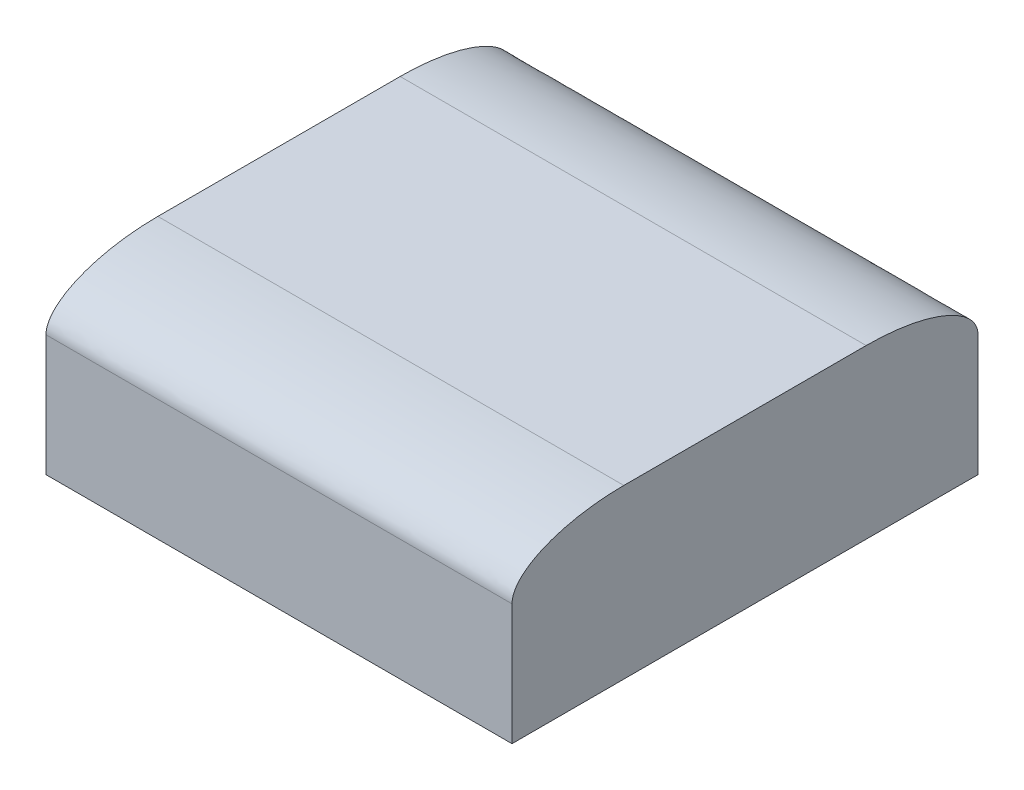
ISO-10303-21;
HEADER;
FILE_DESCRIPTION(('STEP AP214'),'2;1');
FILE_NAME('part.step','',(''),(''),'','','');
FILE_SCHEMA(('AUTOMOTIVE_DESIGN { 1 0 10303 214 1 1 1 1 }'));
ENDSEC;
DATA;
#1=APPLICATION_CONTEXT('core data for automotive mechanical design processes');
#2=APPLICATION_PROTOCOL_DEFINITION('international standard','automotive_design',2000,#1);
#3=PRODUCT_CONTEXT('',#1,'mechanical');
#4=PRODUCT('Part','Part','',(#3));
#5=PRODUCT_RELATED_PRODUCT_CATEGORY('part','',(#4));
#6=PRODUCT_DEFINITION_FORMATION('','',#4);
#7=PRODUCT_DEFINITION_CONTEXT('part definition',#1,'design');
#8=PRODUCT_DEFINITION('design','',#6,#7);
#9=PRODUCT_DEFINITION_SHAPE('','',#8);
#10=(LENGTH_UNIT() NAMED_UNIT(*) SI_UNIT(.MILLI.,.METRE.));
#11=(NAMED_UNIT(*) PLANE_ANGLE_UNIT() SI_UNIT($,.RADIAN.));
#12=(NAMED_UNIT(*) SI_UNIT($,.STERADIAN.) SOLID_ANGLE_UNIT());
#13=UNCERTAINTY_MEASURE_WITH_UNIT(LENGTH_MEASURE(1.E-05),#10,'distance_accuracy_value','');
#14=(GEOMETRIC_REPRESENTATION_CONTEXT(3) GLOBAL_UNCERTAINTY_ASSIGNED_CONTEXT((#13)) GLOBAL_UNIT_ASSIGNED_CONTEXT((#10,
#11,#12)) REPRESENTATION_CONTEXT('',''));
#15=CARTESIAN_POINT('',(0.,0.,0.));
#16=DIRECTION('',(0.,0.,1.));
#17=DIRECTION('',(1.,0.,0.));
#18=AXIS2_PLACEMENT_3D('',#15,#16,#17);
#19=CARTESIAN_POINT('',(0.,18.,0.));
#20=DIRECTION('',(0.,-1.,0.));
#21=DIRECTION('',(0.,0.,-1.));
#22=AXIS2_PLACEMENT_3D('',#19,#20,#21);
#23=PLANE('',#22);
#24=DIRECTION('',(0.,0.,-1.));
#25=VECTOR('',#24,1.);
#26=CARTESIAN_POINT('',(50.,18.,0.));
#27=LINE('',#26,#25);
#28=CARTESIAN_POINT('',(50.,18.,-12.));
#29=VERTEX_POINT('',#28);
#30=CARTESIAN_POINT('',(50.,18.,-38.));
#31=VERTEX_POINT('',#30);
#32=EDGE_CURVE('E139',#29,#31,#27,.T.);
#33=ORIENTED_EDGE('',*,*,#32,.T.);
#34=CARTESIAN_POINT('',(-2.49999999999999,18.,-38.));
#35=CARTESIAN_POINT('',(15.8333333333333,18.,-38.));
#36=CARTESIAN_POINT('',(34.1666666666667,18.,-38.));
#37=CARTESIAN_POINT('',(52.5,18.,-38.));
#38=(BOUNDED_CURVE() B_SPLINE_CURVE(3,(#34,#35,#36,#37),.UNSPECIFIED.,.F.,
.F.) B_SPLINE_CURVE_WITH_KNOTS((4,4),(-0.0525,0.0025),
.UNSPECIFIED.) CURVE() GEOMETRIC_REPRESENTATION_ITEM() RATIONAL_B_SPLINE_CURVE((1.,1.,1.,1.)) REPRESENTATION_ITEM(''));
#39=CARTESIAN_POINT('',(0.,18.,-38.));
#40=VERTEX_POINT('',#39);
#41=EDGE_CURVE('E229',#31,#40,#38,.F.);
#42=ORIENTED_EDGE('',*,*,#41,.T.);
#43=DIRECTION('',(0.,0.,1.));
#44=VECTOR('',#43,1.);
#45=CARTESIAN_POINT('',(0.,18.,0.));
#46=LINE('',#45,#44);
#47=CARTESIAN_POINT('',(0.,18.,-12.));
#48=VERTEX_POINT('',#47);
#49=EDGE_CURVE('E131',#40,#48,#46,.T.);
#50=ORIENTED_EDGE('',*,*,#49,.T.);
#51=CARTESIAN_POINT('',(52.5,18.,-12.));
#52=CARTESIAN_POINT('',(34.1666666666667,18.,-12.));
#53=CARTESIAN_POINT('',(15.8333333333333,18.,-12.));
#54=CARTESIAN_POINT('',(-2.5,18.,-12.));
#55=(BOUNDED_CURVE() B_SPLINE_CURVE(3,(#51,#52,#53,#54),.UNSPECIFIED.,.F.,
.F.) B_SPLINE_CURVE_WITH_KNOTS((4,4),(-0.0025,0.0525),
.UNSPECIFIED.) CURVE() GEOMETRIC_REPRESENTATION_ITEM() RATIONAL_B_SPLINE_CURVE((1.,1.,1.,1.)) REPRESENTATION_ITEM(''));
#56=EDGE_CURVE('E108',#48,#29,#55,.F.);
#57=ORIENTED_EDGE('',*,*,#56,.T.);
#58=EDGE_LOOP('',(#33,#42,#50,#57));
#59=FACE_BOUND('',#58,.T.);
#60=ADVANCED_FACE('F37',(#59),#23,.F.);
#61=CARTESIAN_POINT('',(0.,18.,0.));
#62=DIRECTION('',(1.,0.,0.));
#63=DIRECTION('',(0.,0.,-1.));
#64=AXIS2_PLACEMENT_3D('',#61,#62,#63);
#65=PLANE('',#64);
#66=ORIENTED_EDGE('',*,*,#49,.F.);
#67=CARTESIAN_POINT('',(0.,13.,-50.));
#68=CARTESIAN_POINT('',(0.,18.,-50.));
#69=CARTESIAN_POINT('',(0.,18.,-38.));
#70=(BOUNDED_CURVE() B_SPLINE_CURVE(2,(#67,#68,#69),.UNSPECIFIED.,.F.,
.F.) B_SPLINE_CURVE_WITH_KNOTS((3,3),(0.,1.),
.UNSPECIFIED.) CURVE() GEOMETRIC_REPRESENTATION_ITEM() RATIONAL_B_SPLINE_CURVE((1.,
0.707106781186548,1.)) REPRESENTATION_ITEM(''));
#71=CARTESIAN_POINT('',(0.,13.,-50.));
#72=VERTEX_POINT('',#71);
#73=EDGE_CURVE('E217',#40,#72,#70,.F.);
#74=ORIENTED_EDGE('',*,*,#73,.T.);
#75=DIRECTION('',(0.,-1.,0.));
#76=VECTOR('',#75,1.);
#77=CARTESIAN_POINT('',(0.,18.,-50.));
#78=LINE('',#77,#76);
#79=CARTESIAN_POINT('',(0.,0.,-50.));
#80=VERTEX_POINT('',#79);
#81=EDGE_CURVE('E121',#72,#80,#78,.T.);
#82=ORIENTED_EDGE('',*,*,#81,.T.);
#83=DIRECTION('',(0.,0.,1.));
#84=VECTOR('',#83,1.);
#85=CARTESIAN_POINT('',(0.,0.,0.));
#86=LINE('',#85,#84);
#87=CARTESIAN_POINT('',(0.,0.,0.));
#88=VERTEX_POINT('',#87);
#89=EDGE_CURVE('E115',#80,#88,#86,.T.);
#90=ORIENTED_EDGE('',*,*,#89,.T.);
#91=DIRECTION('',(0.,-1.,0.));
#92=VECTOR('',#91,1.);
#93=CARTESIAN_POINT('',(0.,18.,0.));
#94=LINE('',#93,#92);
#95=CARTESIAN_POINT('',(0.,13.,0.));
#96=VERTEX_POINT('',#95);
#97=EDGE_CURVE('E98',#96,#88,#94,.T.);
#98=ORIENTED_EDGE('',*,*,#97,.F.);
#99=CARTESIAN_POINT('',(0.,18.,-12.));
#100=CARTESIAN_POINT('',(0.,18.,0.));
#101=CARTESIAN_POINT('',(0.,13.,0.));
#102=(BOUNDED_CURVE() B_SPLINE_CURVE(2,(#99,#100,#101),.UNSPECIFIED.,.F.,
.F.) B_SPLINE_CURVE_WITH_KNOTS((3,3),(0.,1.),
.UNSPECIFIED.) CURVE() GEOMETRIC_REPRESENTATION_ITEM() RATIONAL_B_SPLINE_CURVE((1.,
0.707106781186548,1.)) REPRESENTATION_ITEM(''));
#103=EDGE_CURVE('E143',#96,#48,#102,.F.);
#104=ORIENTED_EDGE('',*,*,#103,.T.);
#105=EDGE_LOOP('',(#66,#74,#82,#90,#98,#104));
#106=FACE_BOUND('',#105,.T.);
#107=ADVANCED_FACE('F120',(#106),#65,.F.);
#108=CARTESIAN_POINT('',(0.,18.,0.));
#109=DIRECTION('',(0.,0.,-1.));
#110=DIRECTION('',(-1.,0.,0.));
#111=AXIS2_PLACEMENT_3D('',#108,#109,#110);
#112=PLANE('',#111);
#113=DIRECTION('',(0.,-1.,0.));
#114=VECTOR('',#113,1.);
#115=CARTESIAN_POINT('',(50.,18.,0.));
#116=LINE('',#115,#114);
#117=CARTESIAN_POINT('',(50.,13.,0.));
#118=VERTEX_POINT('',#117);
#119=CARTESIAN_POINT('',(50.,0.,0.));
#120=VERTEX_POINT('',#119);
#121=EDGE_CURVE('E109',#118,#120,#116,.T.);
#122=ORIENTED_EDGE('',*,*,#121,.F.);
#123=CARTESIAN_POINT('',(-2.5,13.,0.));
#124=CARTESIAN_POINT('',(15.8333333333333,13.,0.));
#125=CARTESIAN_POINT('',(34.1666666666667,13.,0.));
#126=CARTESIAN_POINT('',(52.5,13.,0.));
#127=(BOUNDED_CURVE() B_SPLINE_CURVE(3,(#123,#124,#125,#126),.UNSPECIFIED.,.F.,
.F.) B_SPLINE_CURVE_WITH_KNOTS((4,4),(-0.0025,0.0525),
.UNSPECIFIED.) CURVE() GEOMETRIC_REPRESENTATION_ITEM() RATIONAL_B_SPLINE_CURVE((1.,1.,1.,1.)) REPRESENTATION_ITEM(''));
#128=EDGE_CURVE('E12',#118,#96,#127,.F.);
#129=ORIENTED_EDGE('',*,*,#128,.T.);
#130=ORIENTED_EDGE('',*,*,#97,.T.);
#131=DIRECTION('',(1.,0.,0.));
#132=VECTOR('',#131,1.);
#133=CARTESIAN_POINT('',(0.,0.,0.));
#134=LINE('',#133,#132);
#135=EDGE_CURVE('E101',#88,#120,#134,.T.);
#136=ORIENTED_EDGE('',*,*,#135,.T.);
#137=EDGE_LOOP('',(#122,#129,#130,#136));
#138=FACE_BOUND('',#137,.T.);
#139=ADVANCED_FACE('F100',(#138),#112,.F.);
#140=CARTESIAN_POINT('',(50.,18.,0.));
#141=DIRECTION('',(-1.,0.,0.));
#142=DIRECTION('',(0.,0.,1.));
#143=AXIS2_PLACEMENT_3D('',#140,#141,#142);
#144=PLANE('',#143);
#145=DIRECTION('',(0.,-1.,0.));
#146=VECTOR('',#145,1.);
#147=CARTESIAN_POINT('',(50.,18.,-50.));
#148=LINE('',#147,#146);
#149=CARTESIAN_POINT('',(50.,13.,-50.));
#150=VERTEX_POINT('',#149);
#151=CARTESIAN_POINT('',(50.,0.,-50.));
#152=VERTEX_POINT('',#151);
#153=EDGE_CURVE('E138',#150,#152,#148,.T.);
#154=ORIENTED_EDGE('',*,*,#153,.F.);
#155=CARTESIAN_POINT('',(50.,18.,-38.));
#156=CARTESIAN_POINT('',(50.,18.,-50.));
#157=CARTESIAN_POINT('',(50.,13.,-50.));
#158=(BOUNDED_CURVE() B_SPLINE_CURVE(2,(#155,#156,#157),.UNSPECIFIED.,.F.,
.F.) B_SPLINE_CURVE_WITH_KNOTS((3,3),(0.,1.),
.UNSPECIFIED.) CURVE() GEOMETRIC_REPRESENTATION_ITEM() RATIONAL_B_SPLINE_CURVE((1.,
0.707106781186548,1.)) REPRESENTATION_ITEM(''));
#159=EDGE_CURVE('E51',#150,#31,#158,.F.);
#160=ORIENTED_EDGE('',*,*,#159,.T.);
#161=ORIENTED_EDGE('',*,*,#32,.F.);
#162=CARTESIAN_POINT('',(50.,13.,0.));
#163=CARTESIAN_POINT('',(50.,18.,0.));
#164=CARTESIAN_POINT('',(50.,18.,-12.));
#165=(BOUNDED_CURVE() B_SPLINE_CURVE(2,(#162,#163,#164),.UNSPECIFIED.,.F.,
.F.) B_SPLINE_CURVE_WITH_KNOTS((3,3),(0.,1.),
.UNSPECIFIED.) CURVE() GEOMETRIC_REPRESENTATION_ITEM() RATIONAL_B_SPLINE_CURVE((1.,
0.707106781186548,1.)) REPRESENTATION_ITEM(''));
#166=EDGE_CURVE('E58',#29,#118,#165,.F.);
#167=ORIENTED_EDGE('',*,*,#166,.T.);
#168=ORIENTED_EDGE('',*,*,#121,.T.);
#169=DIRECTION('',(0.,0.,-1.));
#170=VECTOR('',#169,1.);
#171=CARTESIAN_POINT('',(50.,0.,0.));
#172=LINE('',#171,#170);
#173=EDGE_CURVE('E117',#120,#152,#172,.T.);
#174=ORIENTED_EDGE('',*,*,#173,.T.);
#175=EDGE_LOOP('',(#154,#160,#161,#167,#168,#174));
#176=FACE_BOUND('',#175,.T.);
#177=ADVANCED_FACE('F188',(#176),#144,.F.);
#178=CARTESIAN_POINT('',(0.,18.,-50.));
#179=DIRECTION('',(0.,0.,1.));
#180=DIRECTION('',(1.,0.,0.));
#181=AXIS2_PLACEMENT_3D('',#178,#179,#180);
#182=PLANE('',#181);
#183=ORIENTED_EDGE('',*,*,#81,.F.);
#184=CARTESIAN_POINT('',(52.5,13.,-50.));
#185=CARTESIAN_POINT('',(34.1666666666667,13.,-50.));
#186=CARTESIAN_POINT('',(15.8333333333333,13.,-50.));
#187=CARTESIAN_POINT('',(-2.49999999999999,13.,-50.));
#188=(BOUNDED_CURVE() B_SPLINE_CURVE(3,(#184,#185,#186,#187),.UNSPECIFIED.,.F.,
.F.) B_SPLINE_CURVE_WITH_KNOTS((4,4),(-0.0525,0.0025),
.UNSPECIFIED.) CURVE() GEOMETRIC_REPRESENTATION_ITEM() RATIONAL_B_SPLINE_CURVE((1.,1.,1.,1.)) REPRESENTATION_ITEM(''));
#189=EDGE_CURVE('E67',#72,#150,#188,.F.);
#190=ORIENTED_EDGE('',*,*,#189,.T.);
#191=ORIENTED_EDGE('',*,*,#153,.T.);
#192=DIRECTION('',(-1.,0.,0.));
#193=VECTOR('',#192,1.);
#194=CARTESIAN_POINT('',(0.,0.,-50.));
#195=LINE('',#194,#193);
#196=EDGE_CURVE('E129',#152,#80,#195,.T.);
#197=ORIENTED_EDGE('',*,*,#196,.T.);
#198=EDGE_LOOP('',(#183,#190,#191,#197));
#199=FACE_BOUND('',#198,.T.);
#200=ADVANCED_FACE('F179',(#199),#182,.F.);
#201=CARTESIAN_POINT('',(0.,0.,0.));
#202=DIRECTION('',(0.,-1.,0.));
#203=DIRECTION('',(0.,0.,-1.));
#204=AXIS2_PLACEMENT_3D('',#201,#202,#203);
#205=PLANE('',#204);
#206=ORIENTED_EDGE('',*,*,#89,.F.);
#207=ORIENTED_EDGE('',*,*,#196,.F.);
#208=ORIENTED_EDGE('',*,*,#173,.F.);
#209=ORIENTED_EDGE('',*,*,#135,.F.);
#210=EDGE_LOOP('',(#206,#207,#208,#209));
#211=FACE_BOUND('',#210,.T.);
#212=ADVANCED_FACE('F113',(#211),#205,.T.);
#213=CARTESIAN_POINT('',(52.5,18.,-38.));
#214=CARTESIAN_POINT('',(34.1666666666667,18.,-38.));
#215=CARTESIAN_POINT('',(15.8333333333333,18.,-38.));
#216=CARTESIAN_POINT('',(-2.49999999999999,18.,-38.));
#217=CARTESIAN_POINT('',(52.5,18.,-50.));
#218=CARTESIAN_POINT('',(34.1666666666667,18.,-50.));
#219=CARTESIAN_POINT('',(15.8333333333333,18.,-50.));
#220=CARTESIAN_POINT('',(-2.49999999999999,18.,-50.));
#221=CARTESIAN_POINT('',(52.5,13.,-50.));
#222=CARTESIAN_POINT('',(34.1666666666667,13.,-50.));
#223=CARTESIAN_POINT('',(15.8333333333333,13.,-50.));
#224=CARTESIAN_POINT('',(-2.49999999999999,13.,-50.));
#225=(BOUNDED_SURFACE() B_SPLINE_SURFACE(2,3,((#213,#214,#215,#216),(#217,#218,#219,#220),(#221,
#222,#223,#224)),.UNSPECIFIED.,.F.,.F.,.F.) B_SPLINE_SURFACE_WITH_KNOTS((3,3),(4,4),(0.,1.),
(-0.0525,0.0025),.UNSPECIFIED.) GEOMETRIC_REPRESENTATION_ITEM() RATIONAL_B_SPLINE_SURFACE(((1.,
1.,1.,1.),(0.707106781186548,0.707106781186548,0.707106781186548,0.707106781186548),(1.,1.,1.,1.))) REPRESENTATION_ITEM('') SURFACE());
#226=ORIENTED_EDGE('',*,*,#159,.F.);
#227=ORIENTED_EDGE('',*,*,#189,.F.);
#228=ORIENTED_EDGE('',*,*,#73,.F.);
#229=ORIENTED_EDGE('',*,*,#41,.F.);
#230=EDGE_LOOP('',(#226,#227,#228,#229));
#231=FACE_BOUND('',#230,.T.);
#232=ADVANCED_FACE('F161',(#231),#225,.T.);
#233=CARTESIAN_POINT('',(-2.5,18.,-12.));
#234=CARTESIAN_POINT('',(15.8333333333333,18.,-12.));
#235=CARTESIAN_POINT('',(34.1666666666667,18.,-12.));
#236=CARTESIAN_POINT('',(52.5,18.,-12.));
#237=CARTESIAN_POINT('',(-2.5,18.,0.));
#238=CARTESIAN_POINT('',(15.8333333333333,18.,0.));
#239=CARTESIAN_POINT('',(34.1666666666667,18.,0.));
#240=CARTESIAN_POINT('',(52.5,18.,0.));
#241=CARTESIAN_POINT('',(-2.5,13.,0.));
#242=CARTESIAN_POINT('',(15.8333333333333,13.,0.));
#243=CARTESIAN_POINT('',(34.1666666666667,13.,0.));
#244=CARTESIAN_POINT('',(52.5,13.,0.));
#245=(BOUNDED_SURFACE() B_SPLINE_SURFACE(2,3,((#233,#234,#235,#236),(#237,#238,#239,#240),(#241,
#242,#243,#244)),.UNSPECIFIED.,.F.,.F.,.F.) B_SPLINE_SURFACE_WITH_KNOTS((3,3),(4,4),(0.,1.),
(-0.0025,0.0525),.UNSPECIFIED.) GEOMETRIC_REPRESENTATION_ITEM() RATIONAL_B_SPLINE_SURFACE(((1.,
1.,1.,1.),(0.707106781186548,0.707106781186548,0.707106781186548,0.707106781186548),(1.,1.,1.,1.))) REPRESENTATION_ITEM('') SURFACE());
#246=ORIENTED_EDGE('',*,*,#103,.F.);
#247=ORIENTED_EDGE('',*,*,#128,.F.);
#248=ORIENTED_EDGE('',*,*,#166,.F.);
#249=ORIENTED_EDGE('',*,*,#56,.F.);
#250=EDGE_LOOP('',(#246,#247,#248,#249));
#251=FACE_BOUND('',#250,.T.);
#252=ADVANCED_FACE('F40',(#251),#245,.T.);
#253=CLOSED_SHELL('',(#60,#107,#139,#177,#200,#212,#232,#252));
#254=MANIFOLD_SOLID_BREP('B2',#253);
#255=ADVANCED_BREP_SHAPE_REPRESENTATION('',(#18,#254),#14);
#256=SHAPE_DEFINITION_REPRESENTATION(#9,#255);
ENDSEC;
END-ISO-10303-21;
